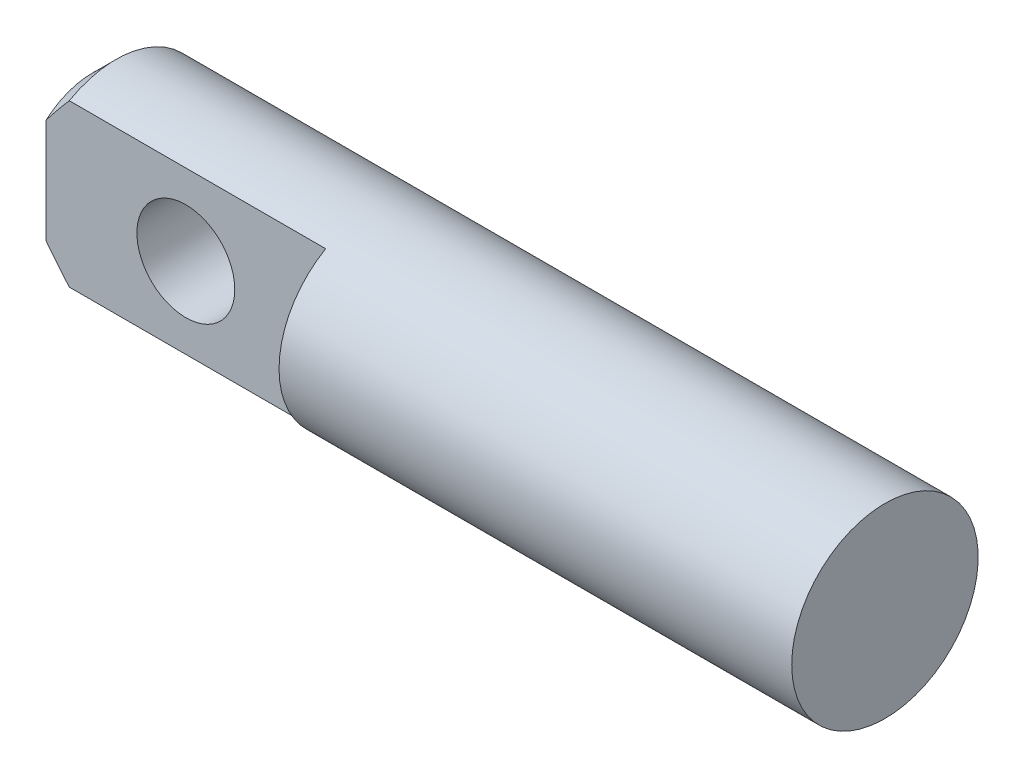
from build123d import *

# Parameters (mm, degrees)
CUT_EXTRUDE1_START = -6
CUT_EXTRUDE1_DEPTH = 6
SKETCH3_R          = 1.05
CUT_EXTRUDE2_DEPTH = 18.378147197


with BuildPart() as part:
    # Sketch1 → Revolve1 (revolve)
    with BuildSketch(Plane.XY, mode=Mode.PRIVATE) as revolve1_sk:
        Polygon((0, 0), (0, 1.5), (0.5, 2), (17, 2), (17, 0), align=None)
    revolve(revolve1_sk.sketch.rotate(Axis((0, 0, 0), (1, 0, 0)), 90), axis=Axis((0, 0, 0), (1, 0, 0)))

    # Sketch2 → Cut-Extrude1 (cut)
    with BuildSketch(Plane.ZY.offset(CUT_EXTRUDE1_START)):
        with BuildLine():
            Line((1, 1.732050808), (1, -1.732050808))
            ThreePointArc((1, -1.732050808), (2, 0), (1, 1.732050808))
        make_face()
    extrude(amount=CUT_EXTRUDE1_DEPTH, mode=Mode.SUBTRACT)

    # Sketch3 → Cut-Extrude2 (cut, through all)
    with BuildSketch(Plane.XY.offset(1)):
        with Locations((3, 0)):
            Circle(SKETCH3_R)
    extrude(amount=-CUT_EXTRUDE2_DEPTH, mode=Mode.SUBTRACT)


solid = part.part
